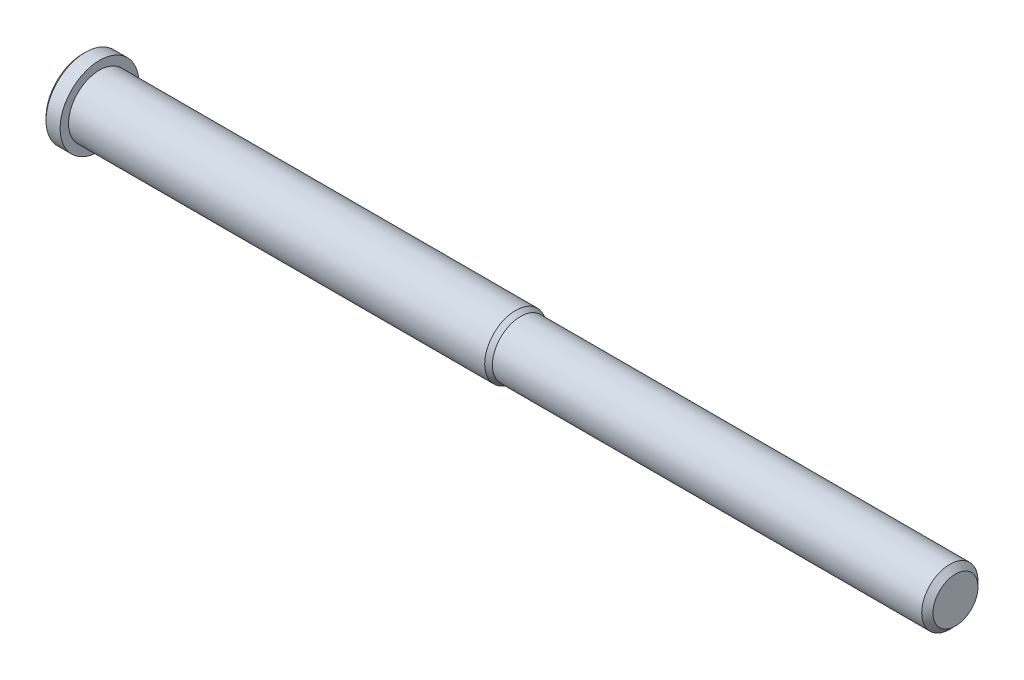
ISO-10303-21;
HEADER;
FILE_DESCRIPTION(('STEP AP214'),'2;1');
FILE_NAME('part.step','',(''),(''),'','','');
FILE_SCHEMA(('AUTOMOTIVE_DESIGN { 1 0 10303 214 1 1 1 1 }'));
ENDSEC;
DATA;
#1=APPLICATION_CONTEXT('core data for automotive mechanical design processes');
#2=APPLICATION_PROTOCOL_DEFINITION('international standard','automotive_design',2000,#1);
#3=PRODUCT_CONTEXT('',#1,'mechanical');
#4=PRODUCT('Part','Part','',(#3));
#5=PRODUCT_RELATED_PRODUCT_CATEGORY('part','',(#4));
#6=PRODUCT_DEFINITION_FORMATION('','',#4);
#7=PRODUCT_DEFINITION_CONTEXT('part definition',#1,'design');
#8=PRODUCT_DEFINITION('design','',#6,#7);
#9=PRODUCT_DEFINITION_SHAPE('','',#8);
#10=(LENGTH_UNIT() NAMED_UNIT(*) SI_UNIT(.MILLI.,.METRE.));
#11=(NAMED_UNIT(*) PLANE_ANGLE_UNIT() SI_UNIT($,.RADIAN.));
#12=(NAMED_UNIT(*) SI_UNIT($,.STERADIAN.) SOLID_ANGLE_UNIT());
#13=UNCERTAINTY_MEASURE_WITH_UNIT(LENGTH_MEASURE(1.E-05),#10,'distance_accuracy_value','');
#14=(GEOMETRIC_REPRESENTATION_CONTEXT(3) GLOBAL_UNCERTAINTY_ASSIGNED_CONTEXT((#13)) GLOBAL_UNIT_ASSIGNED_CONTEXT((#10,
#11,#12)) REPRESENTATION_CONTEXT('',''));
#15=CARTESIAN_POINT('',(0.,0.,0.));
#16=DIRECTION('',(0.,0.,1.));
#17=DIRECTION('',(1.,0.,0.));
#18=AXIS2_PLACEMENT_3D('',#15,#16,#17);
#19=CARTESIAN_POINT('',(0.,0.,0.));
#20=DIRECTION('',(1.,0.,0.));
#21=DIRECTION('',(0.,0.,-1.));
#22=AXIS2_PLACEMENT_3D('',#19,#20,#21);
#23=PLANE('',#22);
#24=CARTESIAN_POINT('',(0.,0.,0.));
#25=DIRECTION('',(1.,0.,0.));
#26=DIRECTION('',(0.,0.,-1.));
#27=AXIS2_PLACEMENT_3D('',#24,#25,#26);
#28=CIRCLE('',#27,12.9999999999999);
#29=CARTESIAN_POINT('',(0.,0.,-12.9999999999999));
#30=VERTEX_POINT('',#29);
#31=EDGE_CURVE('E45',#30,#30,#28,.F.);
#32=ORIENTED_EDGE('',*,*,#31,.T.);
#33=EDGE_LOOP('',(#32));
#34=FACE_BOUND('',#33,.T.);
#35=ADVANCED_FACE('F31',(#34),#23,.F.);
#36=CARTESIAN_POINT('',(0.,0.,0.));
#37=DIRECTION('',(-1.,0.,0.));
#38=DIRECTION('',(0.,0.,1.));
#39=AXIS2_PLACEMENT_3D('',#36,#37,#38);
#40=CYLINDRICAL_SURFACE('',#39,14.);
#41=CARTESIAN_POINT('',(1.00000000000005,0.,0.));
#42=DIRECTION('',(1.,0.,0.));
#43=DIRECTION('',(0.,0.,-1.));
#44=AXIS2_PLACEMENT_3D('',#41,#42,#43);
#45=CIRCLE('',#44,14.);
#46=CARTESIAN_POINT('',(1.00000000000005,0.,-14.));
#47=VERTEX_POINT('',#46);
#48=EDGE_CURVE('E41',#47,#47,#45,.T.);
#49=ORIENTED_EDGE('',*,*,#48,.T.);
#50=EDGE_LOOP('',(#49));
#51=FACE_BOUND('',#50,.T.);
#52=CARTESIAN_POINT('',(6.00000000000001,0.,0.));
#53=DIRECTION('',(-1.,0.,0.));
#54=DIRECTION('',(0.,0.,1.));
#55=AXIS2_PLACEMENT_3D('',#52,#53,#54);
#56=CIRCLE('',#55,14.);
#57=CARTESIAN_POINT('',(6.00000000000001,0.,14.));
#58=VERTEX_POINT('',#57);
#59=EDGE_CURVE('E50',#58,#58,#56,.T.);
#60=ORIENTED_EDGE('',*,*,#59,.T.);
#61=EDGE_LOOP('',(#60));
#62=FACE_BOUND('',#61,.T.);
#63=ADVANCED_FACE('F79',(#51,#62),#40,.T.);
#64=CARTESIAN_POINT('',(6.00000000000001,14.,0.));
#65=DIRECTION('',(-1.,0.,0.));
#66=DIRECTION('',(0.,0.,1.));
#67=AXIS2_PLACEMENT_3D('',#64,#65,#66);
#68=PLANE('',#67);
#69=ORIENTED_EDGE('',*,*,#59,.F.);
#70=EDGE_LOOP('',(#69));
#71=FACE_BOUND('',#70,.T.);
#72=CARTESIAN_POINT('',(6.00000000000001,0.,0.));
#73=DIRECTION('',(-1.,0.,0.));
#74=DIRECTION('',(0.,0.,1.));
#75=AXIS2_PLACEMENT_3D('',#72,#73,#74);
#76=CIRCLE('',#75,11.);
#77=CARTESIAN_POINT('',(6.00000000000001,0.,11.));
#78=VERTEX_POINT('',#77);
#79=EDGE_CURVE('E53',#78,#78,#76,.T.);
#80=ORIENTED_EDGE('',*,*,#79,.T.);
#81=EDGE_LOOP('',(#80));
#82=FACE_BOUND('',#81,.T.);
#83=ADVANCED_FACE('F84',(#71,#82),#68,.F.);
#84=CARTESIAN_POINT('',(0.,0.,0.));
#85=DIRECTION('',(-1.,0.,0.));
#86=DIRECTION('',(0.,0.,1.));
#87=AXIS2_PLACEMENT_3D('',#84,#85,#86);
#88=CYLINDRICAL_SURFACE('',#87,11.);
#89=ORIENTED_EDGE('',*,*,#79,.F.);
#90=EDGE_LOOP('',(#89));
#91=FACE_BOUND('',#90,.T.);
#92=CARTESIAN_POINT('',(153.801738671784,0.,0.));
#93=DIRECTION('',(-1.,0.,0.));
#94=DIRECTION('',(0.,0.,1.));
#95=AXIS2_PLACEMENT_3D('',#92,#93,#94);
#96=CIRCLE('',#95,11.);
#97=CARTESIAN_POINT('',(153.801738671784,0.,11.));
#98=VERTEX_POINT('',#97);
#99=EDGE_CURVE('E56',#98,#98,#96,.T.);
#100=ORIENTED_EDGE('',*,*,#99,.T.);
#101=EDGE_LOOP('',(#100));
#102=FACE_BOUND('',#101,.T.);
#103=ADVANCED_FACE('F75',(#91,#102),#88,.T.);
#104=CARTESIAN_POINT('',(155.533789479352,0.,0.));
#105=DIRECTION('',(-1.,0.,0.));
#106=DIRECTION('',(0.,0.,1.));
#107=AXIS2_PLACEMENT_3D('',#104,#105,#106);
#108=CONICAL_SURFACE('',#107,9.99999999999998,0.523598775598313);
#109=ORIENTED_EDGE('',*,*,#99,.F.);
#110=EDGE_LOOP('',(#109));
#111=FACE_BOUND('',#110,.T.);
#112=CARTESIAN_POINT('',(155.533789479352,0.,0.));
#113=DIRECTION('',(-1.,0.,0.));
#114=DIRECTION('',(0.,0.,1.));
#115=AXIS2_PLACEMENT_3D('',#112,#113,#114);
#116=CIRCLE('',#115,9.99999999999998);
#117=CARTESIAN_POINT('',(155.533789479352,0.,9.99999999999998));
#118=VERTEX_POINT('',#117);
#119=EDGE_CURVE('E59',#118,#118,#116,.T.);
#120=ORIENTED_EDGE('',*,*,#119,.T.);
#121=EDGE_LOOP('',(#120));
#122=FACE_BOUND('',#121,.T.);
#123=ADVANCED_FACE('F63',(#111,#122),#108,.T.);
#124=CARTESIAN_POINT('',(0.,0.,0.));
#125=DIRECTION('',(-1.,0.,0.));
#126=DIRECTION('',(0.,0.,1.));
#127=AXIS2_PLACEMENT_3D('',#124,#125,#126);
#128=CYLINDRICAL_SURFACE('',#127,9.99999999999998);
#129=CARTESIAN_POINT('',(308.,0.,0.));
#130=DIRECTION('',(-1.,0.,0.));
#131=DIRECTION('',(0.,0.,1.));
#132=AXIS2_PLACEMENT_3D('',#129,#130,#131);
#133=CIRCLE('',#132,9.99999999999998);
#134=CARTESIAN_POINT('',(308.,0.,9.99999999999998));
#135=VERTEX_POINT('',#134);
#136=EDGE_CURVE('E37',#135,#135,#133,.T.);
#137=ORIENTED_EDGE('',*,*,#136,.T.);
#138=EDGE_LOOP('',(#137));
#139=FACE_BOUND('',#138,.T.);
#140=ORIENTED_EDGE('',*,*,#119,.F.);
#141=EDGE_LOOP('',(#140));
#142=FACE_BOUND('',#141,.T.);
#143=ADVANCED_FACE('F65',(#139,#142),#128,.T.);
#144=CARTESIAN_POINT('',(310.,9.99999999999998,0.));
#145=DIRECTION('',(-1.,0.,0.));
#146=DIRECTION('',(0.,0.,1.));
#147=AXIS2_PLACEMENT_3D('',#144,#145,#146);
#148=PLANE('',#147);
#149=CARTESIAN_POINT('',(310.,0.,0.));
#150=DIRECTION('',(-1.,0.,0.));
#151=DIRECTION('',(0.,0.,1.));
#152=AXIS2_PLACEMENT_3D('',#149,#150,#151);
#153=CIRCLE('',#152,7.99999999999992);
#154=CARTESIAN_POINT('',(310.,0.,7.99999999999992));
#155=VERTEX_POINT('',#154);
#156=EDGE_CURVE('E10',#155,#155,#153,.F.);
#157=ORIENTED_EDGE('',*,*,#156,.T.);
#158=EDGE_LOOP('',(#157));
#159=FACE_BOUND('',#158,.T.);
#160=ADVANCED_FACE('F67',(#159),#148,.F.);
#161=CARTESIAN_POINT('',(0.,0.,0.));
#162=DIRECTION('',(1.,0.,0.));
#163=DIRECTION('',(0.,0.,-1.));
#164=AXIS2_PLACEMENT_3D('',#161,#162,#163);
#165=CONICAL_SURFACE('',#164,12.9999999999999,0.78539816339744);
#166=ORIENTED_EDGE('',*,*,#48,.F.);
#167=EDGE_LOOP('',(#166));
#168=FACE_BOUND('',#167,.T.);
#169=ORIENTED_EDGE('',*,*,#31,.F.);
#170=EDGE_LOOP('',(#169));
#171=FACE_BOUND('',#170,.T.);
#172=ADVANCED_FACE('F73',(#168,#171),#165,.T.);
#173=CARTESIAN_POINT('',(308.,0.,0.));
#174=DIRECTION('',(-1.,0.,0.));
#175=DIRECTION('',(0.,0.,1.));
#176=AXIS2_PLACEMENT_3D('',#173,#174,#175);
#177=CONICAL_SURFACE('',#176,9.99999999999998,0.785398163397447);
#178=ORIENTED_EDGE('',*,*,#156,.F.);
#179=EDGE_LOOP('',(#178));
#180=FACE_BOUND('',#179,.T.);
#181=ORIENTED_EDGE('',*,*,#136,.F.);
#182=EDGE_LOOP('',(#181));
#183=FACE_BOUND('',#182,.T.);
#184=ADVANCED_FACE('F89',(#180,#183),#177,.T.);
#185=CLOSED_SHELL('',(#35,#63,#83,#103,#123,#143,#160,#172,#184));
#186=MANIFOLD_SOLID_BREP('B2',#185);
#187=ADVANCED_BREP_SHAPE_REPRESENTATION('',(#18,#186),#14);
#188=SHAPE_DEFINITION_REPRESENTATION(#9,#187);
ENDSEC;
END-ISO-10303-21;
